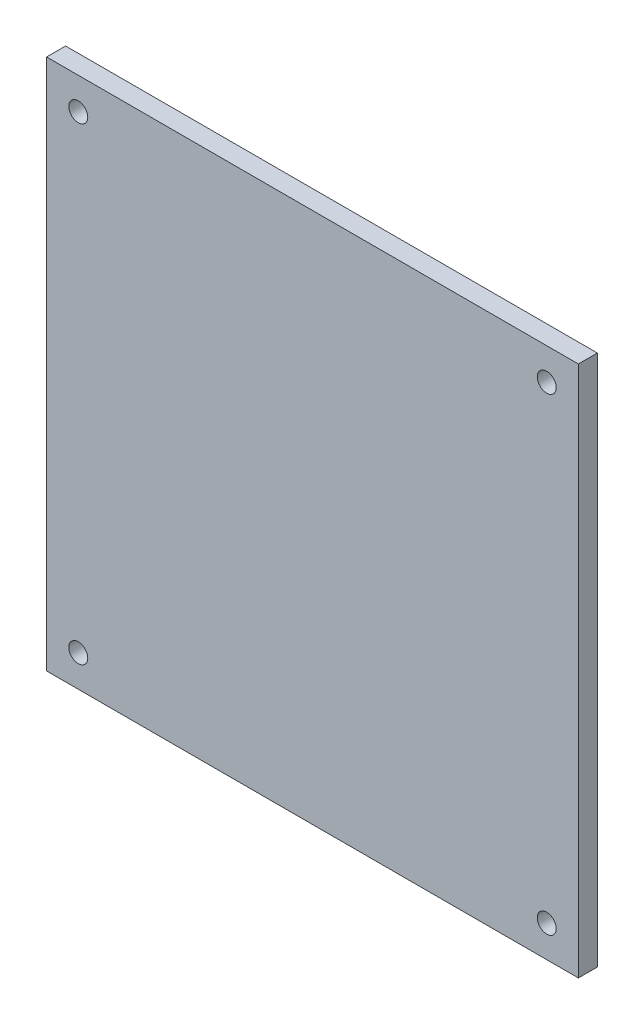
ISO-10303-21;
HEADER;
FILE_DESCRIPTION(('STEP AP214'),'2;1');
FILE_NAME('part.step','',(''),(''),'','','');
FILE_SCHEMA(('AUTOMOTIVE_DESIGN { 1 0 10303 214 1 1 1 1 }'));
ENDSEC;
DATA;
#1=APPLICATION_CONTEXT('core data for automotive mechanical design processes');
#2=APPLICATION_PROTOCOL_DEFINITION('international standard','automotive_design',2000,#1);
#3=PRODUCT_CONTEXT('',#1,'mechanical');
#4=PRODUCT('Part','Part','',(#3));
#5=PRODUCT_RELATED_PRODUCT_CATEGORY('part','',(#4));
#6=PRODUCT_DEFINITION_FORMATION('','',#4);
#7=PRODUCT_DEFINITION_CONTEXT('part definition',#1,'design');
#8=PRODUCT_DEFINITION('design','',#6,#7);
#9=PRODUCT_DEFINITION_SHAPE('','',#8);
#10=(LENGTH_UNIT() NAMED_UNIT(*) SI_UNIT(.MILLI.,.METRE.));
#11=(NAMED_UNIT(*) PLANE_ANGLE_UNIT() SI_UNIT($,.RADIAN.));
#12=(NAMED_UNIT(*) SI_UNIT($,.STERADIAN.) SOLID_ANGLE_UNIT());
#13=UNCERTAINTY_MEASURE_WITH_UNIT(LENGTH_MEASURE(1.E-05),#10,'distance_accuracy_value','');
#14=(GEOMETRIC_REPRESENTATION_CONTEXT(3) GLOBAL_UNCERTAINTY_ASSIGNED_CONTEXT((#13)) GLOBAL_UNIT_ASSIGNED_CONTEXT((#10,
#11,#12)) REPRESENTATION_CONTEXT('',''));
#15=CARTESIAN_POINT('',(0.,0.,0.));
#16=DIRECTION('',(0.,0.,1.));
#17=DIRECTION('',(1.,0.,0.));
#18=AXIS2_PLACEMENT_3D('',#15,#16,#17);
#19=CARTESIAN_POINT('',(0.,0.,3.));
#20=DIRECTION('',(0.,0.,1.));
#21=DIRECTION('',(1.,0.,0.));
#22=AXIS2_PLACEMENT_3D('',#19,#20,#21);
#23=PLANE('',#22);
#24=CARTESIAN_POINT('',(37.0000000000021,-36.9999999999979,3.));
#25=DIRECTION('',(0.,0.,1.));
#26=DIRECTION('',(1.,0.,0.));
#27=AXIS2_PLACEMENT_3D('',#24,#25,#26);
#28=CIRCLE('',#27,1.50000000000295);
#29=CARTESIAN_POINT('',(38.500000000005,-36.9999999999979,3.));
#30=VERTEX_POINT('',#29);
#31=EDGE_CURVE('E120',#30,#30,#28,.T.);
#32=ORIENTED_EDGE('',*,*,#31,.F.);
#33=EDGE_LOOP('',(#32));
#34=FACE_BOUND('',#33,.T.);
#35=CARTESIAN_POINT('',(-37.,37.,3.));
#36=DIRECTION('',(0.,0.,1.));
#37=DIRECTION('',(1.,0.,0.));
#38=AXIS2_PLACEMENT_3D('',#35,#36,#37);
#39=CIRCLE('',#38,1.5);
#40=CARTESIAN_POINT('',(-35.5,37.,3.));
#41=VERTEX_POINT('',#40);
#42=EDGE_CURVE('E99',#41,#41,#39,.T.);
#43=ORIENTED_EDGE('',*,*,#42,.F.);
#44=EDGE_LOOP('',(#43));
#45=FACE_BOUND('',#44,.T.);
#46=DIRECTION('',(0.,1.,0.));
#47=VECTOR('',#46,1.);
#48=CARTESIAN_POINT('',(42.,42.,3.));
#49=LINE('',#48,#47);
#50=CARTESIAN_POINT('',(42.,-42.,3.));
#51=VERTEX_POINT('',#50);
#52=CARTESIAN_POINT('',(42.,42.,3.));
#53=VERTEX_POINT('',#52);
#54=EDGE_CURVE('E84',#51,#53,#49,.T.);
#55=ORIENTED_EDGE('',*,*,#54,.T.);
#56=DIRECTION('',(-1.,0.,0.));
#57=VECTOR('',#56,1.);
#58=CARTESIAN_POINT('',(-42.,42.,3.));
#59=LINE('',#58,#57);
#60=CARTESIAN_POINT('',(-42.,42.,3.));
#61=VERTEX_POINT('',#60);
#62=EDGE_CURVE('E79',#53,#61,#59,.T.);
#63=ORIENTED_EDGE('',*,*,#62,.T.);
#64=DIRECTION('',(0.,-1.,0.));
#65=VECTOR('',#64,1.);
#66=CARTESIAN_POINT('',(-42.,42.,3.));
#67=LINE('',#66,#65);
#68=CARTESIAN_POINT('',(-42.,-42.,3.));
#69=VERTEX_POINT('',#68);
#70=EDGE_CURVE('E82',#61,#69,#67,.T.);
#71=ORIENTED_EDGE('',*,*,#70,.T.);
#72=DIRECTION('',(1.,0.,0.));
#73=VECTOR('',#72,1.);
#74=CARTESIAN_POINT('',(-42.,-42.,3.));
#75=LINE('',#74,#73);
#76=EDGE_CURVE('E49',#69,#51,#75,.T.);
#77=ORIENTED_EDGE('',*,*,#76,.T.);
#78=EDGE_LOOP('',(#55,#63,#71,#77));
#79=FACE_BOUND('',#78,.T.);
#80=CARTESIAN_POINT('',(37.,37.0000000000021,3.));
#81=DIRECTION('',(0.,0.,1.));
#82=DIRECTION('',(1.,0.,0.));
#83=AXIS2_PLACEMENT_3D('',#80,#81,#82);
#84=CIRCLE('',#83,1.50000000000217);
#85=CARTESIAN_POINT('',(38.5000000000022,37.0000000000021,3.));
#86=VERTEX_POINT('',#85);
#87=EDGE_CURVE('E114',#86,#86,#84,.T.);
#88=ORIENTED_EDGE('',*,*,#87,.F.);
#89=EDGE_LOOP('',(#88));
#90=FACE_BOUND('',#89,.T.);
#91=CARTESIAN_POINT('',(-36.9999999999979,-37.,3.));
#92=DIRECTION('',(0.,0.,1.));
#93=DIRECTION('',(1.,0.,0.));
#94=AXIS2_PLACEMENT_3D('',#91,#92,#93);
#95=CIRCLE('',#94,1.5000000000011);
#96=CARTESIAN_POINT('',(-35.4999999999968,-37.,3.));
#97=VERTEX_POINT('',#96);
#98=EDGE_CURVE('E126',#97,#97,#95,.T.);
#99=ORIENTED_EDGE('',*,*,#98,.F.);
#100=EDGE_LOOP('',(#99));
#101=FACE_BOUND('',#100,.T.);
#102=ADVANCED_FACE('F32',(#34,#45,#79,#90,#101),#23,.T.);
#103=CARTESIAN_POINT('',(0.,0.,0.));
#104=DIRECTION('',(0.,0.,1.));
#105=DIRECTION('',(1.,0.,0.));
#106=AXIS2_PLACEMENT_3D('',#103,#104,#105);
#107=PLANE('',#106);
#108=CARTESIAN_POINT('',(8.88999999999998,33.02,0.));
#109=DIRECTION('',(0.,0.,-1.));
#110=DIRECTION('',(-1.,0.,0.));
#111=AXIS2_PLACEMENT_3D('',#108,#109,#110);
#112=CIRCLE('',#111,1.58750000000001);
#113=CARTESIAN_POINT('',(7.30249999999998,33.02,0.));
#114=VERTEX_POINT('',#113);
#115=EDGE_CURVE('E153',#114,#114,#112,.T.);
#116=ORIENTED_EDGE('',*,*,#115,.F.);
#117=EDGE_LOOP('',(#116));
#118=FACE_BOUND('',#117,.T.);
#119=CARTESIAN_POINT('',(-24.13,-19.05,0.));
#120=DIRECTION('',(0.,0.,-1.));
#121=DIRECTION('',(-1.,0.,0.));
#122=AXIS2_PLACEMENT_3D('',#119,#120,#121);
#123=CIRCLE('',#122,1.5875);
#124=CARTESIAN_POINT('',(-25.7175,-19.05,0.));
#125=VERTEX_POINT('',#124);
#126=EDGE_CURVE('E147',#125,#125,#123,.T.);
#127=ORIENTED_EDGE('',*,*,#126,.F.);
#128=EDGE_LOOP('',(#127));
#129=FACE_BOUND('',#128,.T.);
#130=CARTESIAN_POINT('',(24.13,-17.78,0.));
#131=DIRECTION('',(0.,0.,-1.));
#132=DIRECTION('',(-1.,0.,0.));
#133=AXIS2_PLACEMENT_3D('',#130,#131,#132);
#134=CIRCLE('',#133,1.5875);
#135=CARTESIAN_POINT('',(22.5425,-17.78,0.));
#136=VERTEX_POINT('',#135);
#137=EDGE_CURVE('E141',#136,#136,#134,.T.);
#138=ORIENTED_EDGE('',*,*,#137,.F.);
#139=EDGE_LOOP('',(#138));
#140=FACE_BOUND('',#139,.T.);
#141=CARTESIAN_POINT('',(-19.05,33.02,0.));
#142=DIRECTION('',(0.,0.,-1.));
#143=DIRECTION('',(-1.,0.,0.));
#144=AXIS2_PLACEMENT_3D('',#141,#142,#143);
#145=CIRCLE('',#144,1.58750000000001);
#146=CARTESIAN_POINT('',(-20.6375,33.02,0.));
#147=VERTEX_POINT('',#146);
#148=EDGE_CURVE('E135',#147,#147,#145,.T.);
#149=ORIENTED_EDGE('',*,*,#148,.F.);
#150=EDGE_LOOP('',(#149));
#151=FACE_BOUND('',#150,.T.);
#152=DIRECTION('',(0.,1.,0.));
#153=VECTOR('',#152,1.);
#154=CARTESIAN_POINT('',(42.,42.,0.));
#155=LINE('',#154,#153);
#156=CARTESIAN_POINT('',(42.,-42.,0.));
#157=VERTEX_POINT('',#156);
#158=CARTESIAN_POINT('',(42.,42.,0.));
#159=VERTEX_POINT('',#158);
#160=EDGE_CURVE('E96',#157,#159,#155,.T.);
#161=ORIENTED_EDGE('',*,*,#160,.F.);
#162=DIRECTION('',(1.,0.,0.));
#163=VECTOR('',#162,1.);
#164=CARTESIAN_POINT('',(-42.,-42.,0.));
#165=LINE('',#164,#163);
#166=CARTESIAN_POINT('',(-42.,-42.,0.));
#167=VERTEX_POINT('',#166);
#168=EDGE_CURVE('E72',#167,#157,#165,.T.);
#169=ORIENTED_EDGE('',*,*,#168,.F.);
#170=DIRECTION('',(0.,-1.,0.));
#171=VECTOR('',#170,1.);
#172=CARTESIAN_POINT('',(-42.,42.,0.));
#173=LINE('',#172,#171);
#174=CARTESIAN_POINT('',(-42.,42.,0.));
#175=VERTEX_POINT('',#174);
#176=EDGE_CURVE('E66',#175,#167,#173,.T.);
#177=ORIENTED_EDGE('',*,*,#176,.F.);
#178=DIRECTION('',(-1.,0.,0.));
#179=VECTOR('',#178,1.);
#180=CARTESIAN_POINT('',(-42.,42.,0.));
#181=LINE('',#180,#179);
#182=EDGE_CURVE('E88',#159,#175,#181,.T.);
#183=ORIENTED_EDGE('',*,*,#182,.F.);
#184=EDGE_LOOP('',(#161,#169,#177,#183));
#185=FACE_BOUND('',#184,.T.);
#186=CARTESIAN_POINT('',(-37.,37.,0.));
#187=DIRECTION('',(0.,0.,1.));
#188=DIRECTION('',(1.,0.,0.));
#189=AXIS2_PLACEMENT_3D('',#186,#187,#188);
#190=CIRCLE('',#189,1.5);
#191=CARTESIAN_POINT('',(-35.5,37.,0.));
#192=VERTEX_POINT('',#191);
#193=EDGE_CURVE('E111',#192,#192,#190,.T.);
#194=ORIENTED_EDGE('',*,*,#193,.T.);
#195=EDGE_LOOP('',(#194));
#196=FACE_BOUND('',#195,.T.);
#197=CARTESIAN_POINT('',(37.,37.0000000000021,0.));
#198=DIRECTION('',(0.,0.,1.));
#199=DIRECTION('',(1.,0.,0.));
#200=AXIS2_PLACEMENT_3D('',#197,#198,#199);
#201=CIRCLE('',#200,1.50000000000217);
#202=CARTESIAN_POINT('',(38.5000000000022,37.0000000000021,0.));
#203=VERTEX_POINT('',#202);
#204=EDGE_CURVE('E117',#203,#203,#201,.T.);
#205=ORIENTED_EDGE('',*,*,#204,.T.);
#206=EDGE_LOOP('',(#205));
#207=FACE_BOUND('',#206,.T.);
#208=CARTESIAN_POINT('',(37.0000000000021,-36.9999999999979,0.));
#209=DIRECTION('',(0.,0.,1.));
#210=DIRECTION('',(1.,0.,0.));
#211=AXIS2_PLACEMENT_3D('',#208,#209,#210);
#212=CIRCLE('',#211,1.50000000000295);
#213=CARTESIAN_POINT('',(38.500000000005,-36.9999999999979,0.));
#214=VERTEX_POINT('',#213);
#215=EDGE_CURVE('E123',#214,#214,#212,.T.);
#216=ORIENTED_EDGE('',*,*,#215,.T.);
#217=EDGE_LOOP('',(#216));
#218=FACE_BOUND('',#217,.T.);
#219=CARTESIAN_POINT('',(-36.9999999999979,-37.,0.));
#220=DIRECTION('',(0.,0.,1.));
#221=DIRECTION('',(1.,0.,0.));
#222=AXIS2_PLACEMENT_3D('',#219,#220,#221);
#223=CIRCLE('',#222,1.5000000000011);
#224=CARTESIAN_POINT('',(-35.4999999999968,-37.,0.));
#225=VERTEX_POINT('',#224);
#226=EDGE_CURVE('E129',#225,#225,#223,.T.);
#227=ORIENTED_EDGE('',*,*,#226,.T.);
#228=EDGE_LOOP('',(#227));
#229=FACE_BOUND('',#228,.T.);
#230=ADVANCED_FACE('F107',(#118,#129,#140,#151,#185,#196,#207,#218,#229),#107,.F.);
#231=CARTESIAN_POINT('',(42.,42.,3.));
#232=DIRECTION('',(-1.,0.,0.));
#233=DIRECTION('',(0.,-1.,0.));
#234=AXIS2_PLACEMENT_3D('',#231,#232,#233);
#235=PLANE('',#234);
#236=ORIENTED_EDGE('',*,*,#160,.T.);
#237=DIRECTION('',(0.,0.,-1.));
#238=VECTOR('',#237,1.);
#239=CARTESIAN_POINT('',(42.,42.,3.));
#240=LINE('',#239,#238);
#241=EDGE_CURVE('E11',#53,#159,#240,.T.);
#242=ORIENTED_EDGE('',*,*,#241,.F.);
#243=ORIENTED_EDGE('',*,*,#54,.F.);
#244=DIRECTION('',(0.,0.,-1.));
#245=VECTOR('',#244,1.);
#246=CARTESIAN_POINT('',(42.,-42.,3.));
#247=LINE('',#246,#245);
#248=EDGE_CURVE('E92',#51,#157,#247,.T.);
#249=ORIENTED_EDGE('',*,*,#248,.T.);
#250=EDGE_LOOP('',(#236,#242,#243,#249));
#251=FACE_BOUND('',#250,.T.);
#252=ADVANCED_FACE('F34',(#251),#235,.F.);
#253=CARTESIAN_POINT('',(-42.,42.,3.));
#254=DIRECTION('',(0.,-1.,0.));
#255=DIRECTION('',(0.,0.,-1.));
#256=AXIS2_PLACEMENT_3D('',#253,#254,#255);
#257=PLANE('',#256);
#258=ORIENTED_EDGE('',*,*,#182,.T.);
#259=DIRECTION('',(0.,0.,-1.));
#260=VECTOR('',#259,1.);
#261=CARTESIAN_POINT('',(-42.,42.,3.));
#262=LINE('',#261,#260);
#263=EDGE_CURVE('E41',#61,#175,#262,.T.);
#264=ORIENTED_EDGE('',*,*,#263,.F.);
#265=ORIENTED_EDGE('',*,*,#62,.F.);
#266=ORIENTED_EDGE('',*,*,#241,.T.);
#267=EDGE_LOOP('',(#258,#264,#265,#266));
#268=FACE_BOUND('',#267,.T.);
#269=ADVANCED_FACE('F87',(#268),#257,.F.);
#270=CARTESIAN_POINT('',(-42.,42.,3.));
#271=DIRECTION('',(1.,0.,0.));
#272=DIRECTION('',(0.,1.,0.));
#273=AXIS2_PLACEMENT_3D('',#270,#271,#272);
#274=PLANE('',#273);
#275=ORIENTED_EDGE('',*,*,#176,.T.);
#276=DIRECTION('',(0.,0.,-1.));
#277=VECTOR('',#276,1.);
#278=CARTESIAN_POINT('',(-42.,-42.,3.));
#279=LINE('',#278,#277);
#280=EDGE_CURVE('E89',#69,#167,#279,.T.);
#281=ORIENTED_EDGE('',*,*,#280,.F.);
#282=ORIENTED_EDGE('',*,*,#70,.F.);
#283=ORIENTED_EDGE('',*,*,#263,.T.);
#284=EDGE_LOOP('',(#275,#281,#282,#283));
#285=FACE_BOUND('',#284,.T.);
#286=ADVANCED_FACE('F90',(#285),#274,.F.);
#287=CARTESIAN_POINT('',(-42.,-42.,3.));
#288=DIRECTION('',(0.,1.,0.));
#289=DIRECTION('',(0.,0.,1.));
#290=AXIS2_PLACEMENT_3D('',#287,#288,#289);
#291=PLANE('',#290);
#292=ORIENTED_EDGE('',*,*,#168,.T.);
#293=ORIENTED_EDGE('',*,*,#248,.F.);
#294=ORIENTED_EDGE('',*,*,#76,.F.);
#295=ORIENTED_EDGE('',*,*,#280,.T.);
#296=EDGE_LOOP('',(#292,#293,#294,#295));
#297=FACE_BOUND('',#296,.T.);
#298=ADVANCED_FACE('F104',(#297),#291,.F.);
#299=CARTESIAN_POINT('',(-37.,37.,3.));
#300=DIRECTION('',(0.,0.,-1.));
#301=DIRECTION('',(-1.,0.,0.));
#302=AXIS2_PLACEMENT_3D('',#299,#300,#301);
#303=CYLINDRICAL_SURFACE('',#302,1.5);
#304=ORIENTED_EDGE('',*,*,#42,.T.);
#305=EDGE_LOOP('',(#304));
#306=FACE_BOUND('',#305,.T.);
#307=ORIENTED_EDGE('',*,*,#193,.F.);
#308=EDGE_LOOP('',(#307));
#309=FACE_BOUND('',#308,.T.);
#310=ADVANCED_FACE('F203',(#306,#309),#303,.F.);
#311=CARTESIAN_POINT('',(37.,37.0000000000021,3.));
#312=DIRECTION('',(0.,0.,-1.));
#313=DIRECTION('',(-1.,0.,0.));
#314=AXIS2_PLACEMENT_3D('',#311,#312,#313);
#315=CYLINDRICAL_SURFACE('',#314,1.50000000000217);
#316=ORIENTED_EDGE('',*,*,#87,.T.);
#317=EDGE_LOOP('',(#316));
#318=FACE_BOUND('',#317,.T.);
#319=ORIENTED_EDGE('',*,*,#204,.F.);
#320=EDGE_LOOP('',(#319));
#321=FACE_BOUND('',#320,.T.);
#322=ADVANCED_FACE('F300',(#318,#321),#315,.F.);
#323=CARTESIAN_POINT('',(37.0000000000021,-36.9999999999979,3.));
#324=DIRECTION('',(0.,0.,-1.));
#325=DIRECTION('',(-1.,0.,0.));
#326=AXIS2_PLACEMENT_3D('',#323,#324,#325);
#327=CYLINDRICAL_SURFACE('',#326,1.50000000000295);
#328=ORIENTED_EDGE('',*,*,#31,.T.);
#329=EDGE_LOOP('',(#328));
#330=FACE_BOUND('',#329,.T.);
#331=ORIENTED_EDGE('',*,*,#215,.F.);
#332=EDGE_LOOP('',(#331));
#333=FACE_BOUND('',#332,.T.);
#334=ADVANCED_FACE('F190',(#330,#333),#327,.F.);
#335=CARTESIAN_POINT('',(-36.9999999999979,-37.,3.));
#336=DIRECTION('',(0.,0.,-1.));
#337=DIRECTION('',(-1.,0.,0.));
#338=AXIS2_PLACEMENT_3D('',#335,#336,#337);
#339=CYLINDRICAL_SURFACE('',#338,1.5000000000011);
#340=ORIENTED_EDGE('',*,*,#98,.T.);
#341=EDGE_LOOP('',(#340));
#342=FACE_BOUND('',#341,.T.);
#343=ORIENTED_EDGE('',*,*,#226,.F.);
#344=EDGE_LOOP('',(#343));
#345=FACE_BOUND('',#344,.T.);
#346=ADVANCED_FACE('F180',(#342,#345),#339,.F.);
#347=CARTESIAN_POINT('',(-19.05,33.02,1.));
#348=DIRECTION('',(0.,0.,-1.));
#349=DIRECTION('',(-1.,0.,0.));
#350=AXIS2_PLACEMENT_3D('',#347,#348,#349);
#351=CYLINDRICAL_SURFACE('',#350,1.58750000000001);
#352=CARTESIAN_POINT('',(-19.05,33.02,1.));
#353=DIRECTION('',(0.,0.,-1.));
#354=DIRECTION('',(-1.,0.,0.));
#355=AXIS2_PLACEMENT_3D('',#352,#353,#354);
#356=CIRCLE('',#355,1.58750000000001);
#357=CARTESIAN_POINT('',(-20.6375,33.02,1.));
#358=VERTEX_POINT('',#357);
#359=EDGE_CURVE('E132',#358,#358,#356,.T.);
#360=ORIENTED_EDGE('',*,*,#359,.F.);
#361=EDGE_LOOP('',(#360));
#362=FACE_BOUND('',#361,.T.);
#363=ORIENTED_EDGE('',*,*,#148,.T.);
#364=EDGE_LOOP('',(#363));
#365=FACE_BOUND('',#364,.T.);
#366=ADVANCED_FACE('F177',(#362,#365),#351,.F.);
#367=CARTESIAN_POINT('',(-19.05,33.02,1.));
#368=DIRECTION('',(0.,0.,-1.));
#369=DIRECTION('',(-1.,0.,0.));
#370=AXIS2_PLACEMENT_3D('',#367,#368,#369);
#371=PLANE('',#370);
#372=ORIENTED_EDGE('',*,*,#359,.T.);
#373=EDGE_LOOP('',(#372));
#374=FACE_BOUND('',#373,.T.);
#375=ADVANCED_FACE('F179',(#374),#371,.T.);
#376=CARTESIAN_POINT('',(24.13,-17.78,1.));
#377=DIRECTION('',(0.,0.,-1.));
#378=DIRECTION('',(-1.,0.,0.));
#379=AXIS2_PLACEMENT_3D('',#376,#377,#378);
#380=CYLINDRICAL_SURFACE('',#379,1.5875);
#381=CARTESIAN_POINT('',(24.13,-17.78,1.));
#382=DIRECTION('',(0.,0.,-1.));
#383=DIRECTION('',(-1.,0.,0.));
#384=AXIS2_PLACEMENT_3D('',#381,#382,#383);
#385=CIRCLE('',#384,1.5875);
#386=CARTESIAN_POINT('',(22.5425,-17.78,1.));
#387=VERTEX_POINT('',#386);
#388=EDGE_CURVE('E144',#387,#387,#385,.T.);
#389=ORIENTED_EDGE('',*,*,#388,.F.);
#390=EDGE_LOOP('',(#389));
#391=FACE_BOUND('',#390,.T.);
#392=ORIENTED_EDGE('',*,*,#137,.T.);
#393=EDGE_LOOP('',(#392));
#394=FACE_BOUND('',#393,.T.);
#395=ADVANCED_FACE('F187',(#391,#394),#380,.F.);
#396=CARTESIAN_POINT('',(24.13,-17.78,1.));
#397=DIRECTION('',(0.,0.,-1.));
#398=DIRECTION('',(-1.,0.,0.));
#399=AXIS2_PLACEMENT_3D('',#396,#397,#398);
#400=PLANE('',#399);
#401=ORIENTED_EDGE('',*,*,#388,.T.);
#402=EDGE_LOOP('',(#401));
#403=FACE_BOUND('',#402,.T.);
#404=ADVANCED_FACE('F242',(#403),#400,.T.);
#405=CARTESIAN_POINT('',(-24.13,-19.05,1.));
#406=DIRECTION('',(0.,0.,-1.));
#407=DIRECTION('',(-1.,0.,0.));
#408=AXIS2_PLACEMENT_3D('',#405,#406,#407);
#409=CYLINDRICAL_SURFACE('',#408,1.5875);
#410=CARTESIAN_POINT('',(-24.13,-19.05,1.));
#411=DIRECTION('',(0.,0.,-1.));
#412=DIRECTION('',(-1.,0.,0.));
#413=AXIS2_PLACEMENT_3D('',#410,#411,#412);
#414=CIRCLE('',#413,1.5875);
#415=CARTESIAN_POINT('',(-25.7175,-19.05,1.));
#416=VERTEX_POINT('',#415);
#417=EDGE_CURVE('E150',#416,#416,#414,.T.);
#418=ORIENTED_EDGE('',*,*,#417,.F.);
#419=EDGE_LOOP('',(#418));
#420=FACE_BOUND('',#419,.T.);
#421=ORIENTED_EDGE('',*,*,#126,.T.);
#422=EDGE_LOOP('',(#421));
#423=FACE_BOUND('',#422,.T.);
#424=ADVANCED_FACE('F252',(#420,#423),#409,.F.);
#425=CARTESIAN_POINT('',(-24.13,-19.05,1.));
#426=DIRECTION('',(0.,0.,-1.));
#427=DIRECTION('',(-1.,0.,0.));
#428=AXIS2_PLACEMENT_3D('',#425,#426,#427);
#429=PLANE('',#428);
#430=ORIENTED_EDGE('',*,*,#417,.T.);
#431=EDGE_LOOP('',(#430));
#432=FACE_BOUND('',#431,.T.);
#433=ADVANCED_FACE('F164',(#432),#429,.T.);
#434=CARTESIAN_POINT('',(8.88999999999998,33.02,1.));
#435=DIRECTION('',(0.,0.,-1.));
#436=DIRECTION('',(-1.,0.,0.));
#437=AXIS2_PLACEMENT_3D('',#434,#435,#436);
#438=CYLINDRICAL_SURFACE('',#437,1.58750000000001);
#439=CARTESIAN_POINT('',(8.88999999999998,33.02,1.));
#440=DIRECTION('',(0.,0.,-1.));
#441=DIRECTION('',(-1.,0.,0.));
#442=AXIS2_PLACEMENT_3D('',#439,#440,#441);
#443=CIRCLE('',#442,1.58750000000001);
#444=CARTESIAN_POINT('',(7.30249999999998,33.02,1.));
#445=VERTEX_POINT('',#444);
#446=EDGE_CURVE('E138',#445,#445,#443,.T.);
#447=ORIENTED_EDGE('',*,*,#446,.F.);
#448=EDGE_LOOP('',(#447));
#449=FACE_BOUND('',#448,.T.);
#450=ORIENTED_EDGE('',*,*,#115,.T.);
#451=EDGE_LOOP('',(#450));
#452=FACE_BOUND('',#451,.T.);
#453=ADVANCED_FACE('F161',(#449,#452),#438,.F.);
#454=CARTESIAN_POINT('',(8.88999999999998,33.02,1.));
#455=DIRECTION('',(0.,0.,-1.));
#456=DIRECTION('',(-1.,0.,0.));
#457=AXIS2_PLACEMENT_3D('',#454,#455,#456);
#458=PLANE('',#457);
#459=ORIENTED_EDGE('',*,*,#446,.T.);
#460=EDGE_LOOP('',(#459));
#461=FACE_BOUND('',#460,.T.);
#462=ADVANCED_FACE('F159',(#461),#458,.T.);
#463=CLOSED_SHELL('',(#102,#230,#252,#269,#286,#298,#310,#322,#334,#346,#366,#375,#395,#404,
#424,#433,#453,#462));
#464=MANIFOLD_SOLID_BREP('B2',#463);
#465=ADVANCED_BREP_SHAPE_REPRESENTATION('',(#18,#464),#14);
#466=SHAPE_DEFINITION_REPRESENTATION(#9,#465);
ENDSEC;
END-ISO-10303-21;
